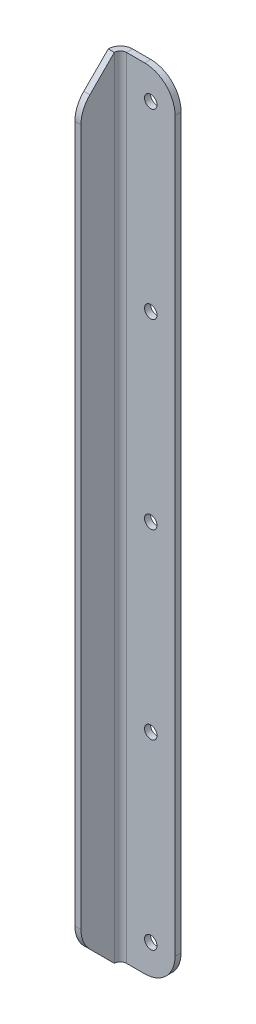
ISO-10303-21;
HEADER;
FILE_DESCRIPTION(('STEP AP214'),'2;1');
FILE_NAME('part.step','',(''),(''),'','','');
FILE_SCHEMA(('AUTOMOTIVE_DESIGN { 1 0 10303 214 1 1 1 1 }'));
ENDSEC;
DATA;
#1=APPLICATION_CONTEXT('core data for automotive mechanical design processes');
#2=APPLICATION_PROTOCOL_DEFINITION('international standard','automotive_design',2000,#1);
#3=PRODUCT_CONTEXT('',#1,'mechanical');
#4=PRODUCT('Part','Part','',(#3));
#5=PRODUCT_RELATED_PRODUCT_CATEGORY('part','',(#4));
#6=PRODUCT_DEFINITION_FORMATION('','',#4);
#7=PRODUCT_DEFINITION_CONTEXT('part definition',#1,'design');
#8=PRODUCT_DEFINITION('design','',#6,#7);
#9=PRODUCT_DEFINITION_SHAPE('','',#8);
#10=(LENGTH_UNIT() NAMED_UNIT(*) SI_UNIT(.MILLI.,.METRE.));
#11=(NAMED_UNIT(*) PLANE_ANGLE_UNIT() SI_UNIT($,.RADIAN.));
#12=(NAMED_UNIT(*) SI_UNIT($,.STERADIAN.) SOLID_ANGLE_UNIT());
#13=UNCERTAINTY_MEASURE_WITH_UNIT(LENGTH_MEASURE(1.E-05),#10,'distance_accuracy_value','');
#14=(GEOMETRIC_REPRESENTATION_CONTEXT(3) GLOBAL_UNCERTAINTY_ASSIGNED_CONTEXT((#13)) GLOBAL_UNIT_ASSIGNED_CONTEXT((#10,
#11,#12)) REPRESENTATION_CONTEXT('',''));
#15=CARTESIAN_POINT('',(0.,0.,0.));
#16=DIRECTION('',(0.,0.,1.));
#17=DIRECTION('',(1.,0.,0.));
#18=AXIS2_PLACEMENT_3D('',#15,#16,#17);
#19=CARTESIAN_POINT('',(8.,-130.,-2.));
#20=DIRECTION('',(1.,0.,0.));
#21=DIRECTION('',(0.,0.,-1.));
#22=AXIS2_PLACEMENT_3D('',#19,#20,#21);
#23=PLANE('',#22);
#24=DIRECTION('',(0.,1.,0.));
#25=VECTOR('',#24,1.);
#26=CARTESIAN_POINT('',(8.,-130.,0.));
#27=LINE('',#26,#25);
#28=CARTESIAN_POINT('',(8.,-120.,0.));
#29=VERTEX_POINT('',#28);
#30=CARTESIAN_POINT('',(8.,120.,0.));
#31=VERTEX_POINT('',#30);
#32=EDGE_CURVE('E247',#29,#31,#27,.T.);
#33=ORIENTED_EDGE('',*,*,#32,.F.);
#34=DIRECTION('',(0.,0.,1.));
#35=VECTOR('',#34,1.);
#36=CARTESIAN_POINT('',(8.,-120.,-2.));
#37=LINE('',#36,#35);
#38=CARTESIAN_POINT('',(8.,-120.,-2.));
#39=VERTEX_POINT('',#38);
#40=EDGE_CURVE('E219',#29,#39,#37,.F.);
#41=ORIENTED_EDGE('',*,*,#40,.T.);
#42=DIRECTION('',(0.,1.,0.));
#43=VECTOR('',#42,1.);
#44=CARTESIAN_POINT('',(8.,-130.,-2.));
#45=LINE('',#44,#43);
#46=CARTESIAN_POINT('',(8.,120.,-2.));
#47=VERTEX_POINT('',#46);
#48=EDGE_CURVE('E253',#39,#47,#45,.T.);
#49=ORIENTED_EDGE('',*,*,#48,.T.);
#50=DIRECTION('',(0.,0.,1.));
#51=VECTOR('',#50,1.);
#52=CARTESIAN_POINT('',(8.,120.,-2.));
#53=LINE('',#52,#51);
#54=EDGE_CURVE('E216',#47,#31,#53,.T.);
#55=ORIENTED_EDGE('',*,*,#54,.T.);
#56=EDGE_LOOP('',(#33,#41,#49,#55));
#57=FACE_BOUND('',#56,.T.);
#58=ADVANCED_FACE('F57',(#57),#23,.T.);
#59=CARTESIAN_POINT('',(-8.,-130.,-2.));
#60=DIRECTION('',(0.,-1.,0.));
#61=DIRECTION('',(0.,0.,-1.));
#62=AXIS2_PLACEMENT_3D('',#59,#60,#61);
#63=PLANE('',#62);
#64=DIRECTION('',(1.,0.,0.));
#65=VECTOR('',#64,1.);
#66=CARTESIAN_POINT('',(-8.,-130.,-2.));
#67=LINE('',#66,#65);
#68=CARTESIAN_POINT('',(-8.,-130.,-2.));
#69=VERTEX_POINT('',#68);
#70=CARTESIAN_POINT('',(-2.,-130.,-2.));
#71=VERTEX_POINT('',#70);
#72=EDGE_CURVE('E259',#69,#71,#67,.T.);
#73=ORIENTED_EDGE('',*,*,#72,.T.);
#74=DIRECTION('',(0.,0.,1.));
#75=VECTOR('',#74,1.);
#76=CARTESIAN_POINT('',(-2.,-130.,-2.));
#77=LINE('',#76,#75);
#78=CARTESIAN_POINT('',(-2.,-130.,0.));
#79=VERTEX_POINT('',#78);
#80=EDGE_CURVE('E209',#71,#79,#77,.T.);
#81=ORIENTED_EDGE('',*,*,#80,.T.);
#82=DIRECTION('',(1.,0.,0.));
#83=VECTOR('',#82,1.);
#84=CARTESIAN_POINT('',(-8.,-130.,0.));
#85=LINE('',#84,#83);
#86=CARTESIAN_POINT('',(-8.,-130.,0.));
#87=VERTEX_POINT('',#86);
#88=EDGE_CURVE('E256',#87,#79,#85,.T.);
#89=ORIENTED_EDGE('',*,*,#88,.F.);
#90=DIRECTION('',(0.,0.,1.));
#91=VECTOR('',#90,1.);
#92=CARTESIAN_POINT('',(-8.,-130.,-2.));
#93=LINE('',#92,#91);
#94=EDGE_CURVE('E271',#69,#87,#93,.T.);
#95=ORIENTED_EDGE('',*,*,#94,.F.);
#96=EDGE_LOOP('',(#73,#81,#89,#95));
#97=FACE_BOUND('',#96,.T.);
#98=ADVANCED_FACE('F295',(#97),#63,.T.);
#99=CARTESIAN_POINT('',(-8.,130.,-2.));
#100=DIRECTION('',(0.,1.,0.));
#101=DIRECTION('',(0.,0.,1.));
#102=AXIS2_PLACEMENT_3D('',#99,#100,#101);
#103=PLANE('',#102);
#104=DIRECTION('',(-1.,0.,0.));
#105=VECTOR('',#104,1.);
#106=CARTESIAN_POINT('',(-8.,130.,0.));
#107=LINE('',#106,#105);
#108=CARTESIAN_POINT('',(-2.,130.,0.));
#109=VERTEX_POINT('',#108);
#110=CARTESIAN_POINT('',(-8.,130.,0.));
#111=VERTEX_POINT('',#110);
#112=EDGE_CURVE('E265',#109,#111,#107,.T.);
#113=ORIENTED_EDGE('',*,*,#112,.F.);
#114=DIRECTION('',(0.,0.,1.));
#115=VECTOR('',#114,1.);
#116=CARTESIAN_POINT('',(-2.,130.,-2.));
#117=LINE('',#116,#115);
#118=CARTESIAN_POINT('',(-2.,130.,-2.));
#119=VERTEX_POINT('',#118);
#120=EDGE_CURVE('E13',#109,#119,#117,.F.);
#121=ORIENTED_EDGE('',*,*,#120,.T.);
#122=DIRECTION('',(-1.,0.,0.));
#123=VECTOR('',#122,1.);
#124=CARTESIAN_POINT('',(-8.,130.,-2.));
#125=LINE('',#124,#123);
#126=CARTESIAN_POINT('',(-8.,130.,-2.));
#127=VERTEX_POINT('',#126);
#128=EDGE_CURVE('E255',#119,#127,#125,.T.);
#129=ORIENTED_EDGE('',*,*,#128,.T.);
#130=DIRECTION('',(0.,0.,1.));
#131=VECTOR('',#130,1.);
#132=CARTESIAN_POINT('',(-8.,130.,-2.));
#133=LINE('',#132,#131);
#134=EDGE_CURVE('E262',#127,#111,#133,.T.);
#135=ORIENTED_EDGE('',*,*,#134,.T.);
#136=EDGE_LOOP('',(#113,#121,#129,#135));
#137=FACE_BOUND('',#136,.T.);
#138=ADVANCED_FACE('F288',(#137),#103,.T.);
#139=CARTESIAN_POINT('',(0.,0.,-2.));
#140=DIRECTION('',(0.,0.,-1.));
#141=DIRECTION('',(-1.,0.,0.));
#142=AXIS2_PLACEMENT_3D('',#139,#140,#141);
#143=PLANE('',#142);
#144=CARTESIAN_POINT('',(1.25693328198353E-12,120.,-2.));
#145=DIRECTION('',(0.,0.,-1.));
#146=DIRECTION('',(-1.,0.,0.));
#147=AXIS2_PLACEMENT_3D('',#144,#145,#146);
#148=CIRCLE('',#147,2.05);
#149=CARTESIAN_POINT('',(-2.04999999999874,120.,-2.));
#150=VERTEX_POINT('',#149);
#151=EDGE_CURVE('E227',#150,#150,#148,.T.);
#152=ORIENTED_EDGE('',*,*,#151,.F.);
#153=EDGE_LOOP('',(#152));
#154=FACE_BOUND('',#153,.T.);
#155=CARTESIAN_POINT('',(6.28466640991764E-13,60.,-2.));
#156=DIRECTION('',(0.,0.,-1.));
#157=DIRECTION('',(-1.,0.,0.));
#158=AXIS2_PLACEMENT_3D('',#155,#156,#157);
#159=CIRCLE('',#158,2.05);
#160=CARTESIAN_POINT('',(-2.04999999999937,60.,-2.));
#161=VERTEX_POINT('',#160);
#162=EDGE_CURVE('E352',#161,#161,#159,.T.);
#163=ORIENTED_EDGE('',*,*,#162,.F.);
#164=EDGE_LOOP('',(#163));
#165=FACE_BOUND('',#164,.T.);
#166=CARTESIAN_POINT('',(0.,0.,-2.));
#167=DIRECTION('',(0.,0.,-1.));
#168=DIRECTION('',(-1.,0.,0.));
#169=AXIS2_PLACEMENT_3D('',#166,#167,#168);
#170=CIRCLE('',#169,2.05);
#171=CARTESIAN_POINT('',(-2.05,0.,-2.));
#172=VERTEX_POINT('',#171);
#173=EDGE_CURVE('E349',#172,#172,#170,.T.);
#174=ORIENTED_EDGE('',*,*,#173,.F.);
#175=EDGE_LOOP('',(#174));
#176=FACE_BOUND('',#175,.T.);
#177=CARTESIAN_POINT('',(-6.28466640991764E-13,-60.,-2.));
#178=DIRECTION('',(0.,0.,-1.));
#179=DIRECTION('',(-1.,0.,0.));
#180=AXIS2_PLACEMENT_3D('',#177,#178,#179);
#181=CIRCLE('',#180,2.05);
#182=CARTESIAN_POINT('',(-2.05000000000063,-60.,-2.));
#183=VERTEX_POINT('',#182);
#184=EDGE_CURVE('E346',#183,#183,#181,.T.);
#185=ORIENTED_EDGE('',*,*,#184,.F.);
#186=EDGE_LOOP('',(#185));
#187=FACE_BOUND('',#186,.T.);
#188=CARTESIAN_POINT('',(-1.25693328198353E-12,-120.,-2.));
#189=DIRECTION('',(0.,0.,-1.));
#190=DIRECTION('',(-1.,0.,0.));
#191=AXIS2_PLACEMENT_3D('',#188,#189,#190);
#192=CIRCLE('',#191,2.05);
#193=CARTESIAN_POINT('',(-2.05000000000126,-120.,-2.));
#194=VERTEX_POINT('',#193);
#195=EDGE_CURVE('E343',#194,#194,#192,.T.);
#196=ORIENTED_EDGE('',*,*,#195,.F.);
#197=EDGE_LOOP('',(#196));
#198=FACE_BOUND('',#197,.T.);
#199=ORIENTED_EDGE('',*,*,#48,.F.);
#200=CARTESIAN_POINT('',(-2.,-120.,-2.));
#201=DIRECTION('',(0.,0.,-1.));
#202=DIRECTION('',(-1.,0.,0.));
#203=AXIS2_PLACEMENT_3D('',#200,#201,#202);
#204=CIRCLE('',#203,10.);
#205=EDGE_CURVE('E66',#39,#71,#204,.T.);
#206=ORIENTED_EDGE('',*,*,#205,.T.);
#207=ORIENTED_EDGE('',*,*,#72,.F.);
#208=DIRECTION('',(0.,-1.,0.));
#209=VECTOR('',#208,1.);
#210=CARTESIAN_POINT('',(-8.,-130.,-2.));
#211=LINE('',#210,#209);
#212=EDGE_CURVE('E157',#127,#69,#211,.T.);
#213=ORIENTED_EDGE('',*,*,#212,.F.);
#214=ORIENTED_EDGE('',*,*,#128,.F.);
#215=CARTESIAN_POINT('',(-2.,120.,-2.));
#216=DIRECTION('',(0.,0.,-1.));
#217=DIRECTION('',(-1.,0.,0.));
#218=AXIS2_PLACEMENT_3D('',#215,#216,#217);
#219=CIRCLE('',#218,10.);
#220=EDGE_CURVE('E79',#119,#47,#219,.T.);
#221=ORIENTED_EDGE('',*,*,#220,.T.);
#222=EDGE_LOOP('',(#199,#206,#207,#213,#214,#221));
#223=FACE_BOUND('',#222,.T.);
#224=ADVANCED_FACE('F289',(#154,#165,#176,#187,#198,#223),#143,.T.);
#225=CARTESIAN_POINT('',(0.,0.,0.));
#226=DIRECTION('',(0.,0.,-1.));
#227=DIRECTION('',(-1.,0.,0.));
#228=AXIS2_PLACEMENT_3D('',#225,#226,#227);
#229=PLANE('',#228);
#230=CARTESIAN_POINT('',(1.25693328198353E-12,120.,0.));
#231=DIRECTION('',(0.,0.,-1.));
#232=DIRECTION('',(-1.,0.,0.));
#233=AXIS2_PLACEMENT_3D('',#230,#231,#232);
#234=CIRCLE('',#233,2.05);
#235=CARTESIAN_POINT('',(-2.04999999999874,120.,0.));
#236=VERTEX_POINT('',#235);
#237=EDGE_CURVE('E61',#236,#236,#234,.T.);
#238=ORIENTED_EDGE('',*,*,#237,.T.);
#239=EDGE_LOOP('',(#238));
#240=FACE_BOUND('',#239,.T.);
#241=CARTESIAN_POINT('',(6.28466640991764E-13,60.,0.));
#242=DIRECTION('',(0.,0.,-1.));
#243=DIRECTION('',(-1.,0.,0.));
#244=AXIS2_PLACEMENT_3D('',#241,#242,#243);
#245=CIRCLE('',#244,2.05);
#246=CARTESIAN_POINT('',(-2.04999999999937,60.,0.));
#247=VERTEX_POINT('',#246);
#248=EDGE_CURVE('E232',#247,#247,#245,.T.);
#249=ORIENTED_EDGE('',*,*,#248,.T.);
#250=EDGE_LOOP('',(#249));
#251=FACE_BOUND('',#250,.T.);
#252=CARTESIAN_POINT('',(0.,0.,0.));
#253=DIRECTION('',(0.,0.,-1.));
#254=DIRECTION('',(-1.,0.,0.));
#255=AXIS2_PLACEMENT_3D('',#252,#253,#254);
#256=CIRCLE('',#255,2.05);
#257=CARTESIAN_POINT('',(-2.05,0.,0.));
#258=VERTEX_POINT('',#257);
#259=EDGE_CURVE('E230',#258,#258,#256,.T.);
#260=ORIENTED_EDGE('',*,*,#259,.T.);
#261=EDGE_LOOP('',(#260));
#262=FACE_BOUND('',#261,.T.);
#263=CARTESIAN_POINT('',(-6.28466640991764E-13,-60.,0.));
#264=DIRECTION('',(0.,0.,-1.));
#265=DIRECTION('',(-1.,0.,0.));
#266=AXIS2_PLACEMENT_3D('',#263,#264,#265);
#267=CIRCLE('',#266,2.05);
#268=CARTESIAN_POINT('',(-2.05000000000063,-60.,0.));
#269=VERTEX_POINT('',#268);
#270=EDGE_CURVE('E226',#269,#269,#267,.T.);
#271=ORIENTED_EDGE('',*,*,#270,.T.);
#272=EDGE_LOOP('',(#271));
#273=FACE_BOUND('',#272,.T.);
#274=CARTESIAN_POINT('',(-1.25693328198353E-12,-120.,0.));
#275=DIRECTION('',(0.,0.,-1.));
#276=DIRECTION('',(-1.,0.,0.));
#277=AXIS2_PLACEMENT_3D('',#274,#275,#276);
#278=CIRCLE('',#277,2.05);
#279=CARTESIAN_POINT('',(-2.05000000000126,-120.,0.));
#280=VERTEX_POINT('',#279);
#281=EDGE_CURVE('E223',#280,#280,#278,.T.);
#282=ORIENTED_EDGE('',*,*,#281,.T.);
#283=EDGE_LOOP('',(#282));
#284=FACE_BOUND('',#283,.T.);
#285=ORIENTED_EDGE('',*,*,#88,.T.);
#286=CARTESIAN_POINT('',(-2.,-120.,0.));
#287=DIRECTION('',(0.,0.,-1.));
#288=DIRECTION('',(-1.,0.,0.));
#289=AXIS2_PLACEMENT_3D('',#286,#287,#288);
#290=CIRCLE('',#289,10.);
#291=EDGE_CURVE('E214',#79,#29,#290,.F.);
#292=ORIENTED_EDGE('',*,*,#291,.T.);
#293=ORIENTED_EDGE('',*,*,#32,.T.);
#294=CARTESIAN_POINT('',(-2.,120.,0.));
#295=DIRECTION('',(0.,0.,-1.));
#296=DIRECTION('',(-1.,0.,0.));
#297=AXIS2_PLACEMENT_3D('',#294,#295,#296);
#298=CIRCLE('',#297,10.);
#299=EDGE_CURVE('E212',#31,#109,#298,.F.);
#300=ORIENTED_EDGE('',*,*,#299,.T.);
#301=ORIENTED_EDGE('',*,*,#112,.T.);
#302=DIRECTION('',(0.,-1.,0.));
#303=VECTOR('',#302,1.);
#304=CARTESIAN_POINT('',(-8.,-130.,0.));
#305=LINE('',#304,#303);
#306=EDGE_CURVE('E267',#111,#87,#305,.T.);
#307=ORIENTED_EDGE('',*,*,#306,.T.);
#308=EDGE_LOOP('',(#285,#292,#293,#300,#301,#307));
#309=FACE_BOUND('',#308,.T.);
#310=ADVANCED_FACE('F297',(#240,#251,#262,#273,#284,#309),#229,.F.);
#311=CARTESIAN_POINT('',(-8.,130.,2.));
#312=DIRECTION('',(0.,1.,0.));
#313=DIRECTION('',(0.,0.,1.));
#314=AXIS2_PLACEMENT_3D('',#311,#312,#313);
#315=PLANE('',#314);
#316=DIRECTION('',(1.,0.,0.));
#317=VECTOR('',#316,1.);
#318=CARTESIAN_POINT('',(-12.,130.,1.99999999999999));
#319=LINE('',#318,#317);
#320=CARTESIAN_POINT('',(-10.,130.,1.99999999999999));
#321=VERTEX_POINT('',#320);
#322=CARTESIAN_POINT('',(-12.,130.,1.99999999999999));
#323=VERTEX_POINT('',#322);
#324=EDGE_CURVE('E237',#321,#323,#319,.F.);
#325=ORIENTED_EDGE('',*,*,#324,.F.);
#326=CARTESIAN_POINT('',(-8.,130.,2.));
#327=DIRECTION('',(0.,-1.,0.));
#328=DIRECTION('',(0.,0.,-1.));
#329=AXIS2_PLACEMENT_3D('',#326,#327,#328);
#330=CIRCLE('',#329,2.);
#331=EDGE_CURVE('E161',#111,#321,#330,.F.);
#332=ORIENTED_EDGE('',*,*,#331,.F.);
#333=ORIENTED_EDGE('',*,*,#134,.F.);
#334=CARTESIAN_POINT('',(-8.,130.,2.));
#335=DIRECTION('',(0.,-1.,0.));
#336=DIRECTION('',(0.,0.,-1.));
#337=AXIS2_PLACEMENT_3D('',#334,#335,#336);
#338=CIRCLE('',#337,4.);
#339=EDGE_CURVE('E160',#127,#323,#338,.F.);
#340=ORIENTED_EDGE('',*,*,#339,.T.);
#341=EDGE_LOOP('',(#325,#332,#333,#340));
#342=FACE_BOUND('',#341,.T.);
#343=ADVANCED_FACE('F287',(#342),#315,.T.);
#344=CARTESIAN_POINT('',(-8.,-130.,2.));
#345=DIRECTION('',(0.,1.,0.));
#346=DIRECTION('',(0.,0.,1.));
#347=AXIS2_PLACEMENT_3D('',#344,#345,#346);
#348=PLANE('',#347);
#349=CARTESIAN_POINT('',(-8.,-130.,2.));
#350=DIRECTION('',(0.,-1.,0.));
#351=DIRECTION('',(0.,0.,-1.));
#352=AXIS2_PLACEMENT_3D('',#349,#350,#351);
#353=CIRCLE('',#352,2.);
#354=CARTESIAN_POINT('',(-10.,-130.,1.99999999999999));
#355=VERTEX_POINT('',#354);
#356=EDGE_CURVE('E168',#355,#87,#353,.T.);
#357=ORIENTED_EDGE('',*,*,#356,.F.);
#358=DIRECTION('',(1.,0.,0.));
#359=VECTOR('',#358,1.);
#360=CARTESIAN_POINT('',(-10.,-130.,1.99999999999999));
#361=LINE('',#360,#359);
#362=CARTESIAN_POINT('',(-12.,-130.,1.99999999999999));
#363=VERTEX_POINT('',#362);
#364=EDGE_CURVE('E165',#355,#363,#361,.F.);
#365=ORIENTED_EDGE('',*,*,#364,.T.);
#366=CARTESIAN_POINT('',(-8.,-130.,2.));
#367=DIRECTION('',(0.,-1.,0.));
#368=DIRECTION('',(0.,0.,-1.));
#369=AXIS2_PLACEMENT_3D('',#366,#367,#368);
#370=CIRCLE('',#369,4.);
#371=EDGE_CURVE('E149',#363,#69,#370,.T.);
#372=ORIENTED_EDGE('',*,*,#371,.T.);
#373=ORIENTED_EDGE('',*,*,#94,.T.);
#374=EDGE_LOOP('',(#357,#365,#372,#373));
#375=FACE_BOUND('',#374,.T.);
#376=ADVANCED_FACE('F166',(#375),#348,.F.);
#377=CARTESIAN_POINT('',(-8.,-130.,2.));
#378=DIRECTION('',(0.,-1.,0.));
#379=DIRECTION('',(-1.,0.,0.));
#380=AXIS2_PLACEMENT_3D('',#377,#378,#379);
#381=CYLINDRICAL_SURFACE('',#380,4.);
#382=ORIENTED_EDGE('',*,*,#212,.T.);
#383=ORIENTED_EDGE('',*,*,#371,.F.);
#384=DIRECTION('',(0.,-1.,0.));
#385=VECTOR('',#384,1.);
#386=CARTESIAN_POINT('',(-12.,130.,1.99999999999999));
#387=LINE('',#386,#385);
#388=EDGE_CURVE('E154',#363,#323,#387,.F.);
#389=ORIENTED_EDGE('',*,*,#388,.T.);
#390=ORIENTED_EDGE('',*,*,#339,.F.);
#391=EDGE_LOOP('',(#382,#383,#389,#390));
#392=FACE_BOUND('',#391,.T.);
#393=ADVANCED_FACE('F151',(#392),#381,.T.);
#394=CARTESIAN_POINT('',(-8.,-130.,2.));
#395=DIRECTION('',(0.,-1.,0.));
#396=DIRECTION('',(-1.,0.,0.));
#397=AXIS2_PLACEMENT_3D('',#394,#395,#396);
#398=CYLINDRICAL_SURFACE('',#397,2.);
#399=ORIENTED_EDGE('',*,*,#306,.F.);
#400=ORIENTED_EDGE('',*,*,#331,.T.);
#401=DIRECTION('',(0.,-1.,0.));
#402=VECTOR('',#401,1.);
#403=CARTESIAN_POINT('',(-10.,130.,1.99999999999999));
#404=LINE('',#403,#402);
#405=EDGE_CURVE('E172',#321,#355,#404,.T.);
#406=ORIENTED_EDGE('',*,*,#405,.T.);
#407=ORIENTED_EDGE('',*,*,#356,.T.);
#408=EDGE_LOOP('',(#399,#400,#406,#407));
#409=FACE_BOUND('',#408,.T.);
#410=ADVANCED_FACE('F283',(#409),#398,.F.);
#411=CARTESIAN_POINT('',(-12.,0.,0.));
#412=DIRECTION('',(1.,0.,0.));
#413=DIRECTION('',(0.,0.,-1.));
#414=AXIS2_PLACEMENT_3D('',#411,#412,#413);
#415=PLANE('',#414);
#416=DIRECTION('',(0.,1.,0.));
#417=VECTOR('',#416,1.);
#418=CARTESIAN_POINT('',(-12.,0.,13.));
#419=LINE('',#418,#417);
#420=CARTESIAN_POINT('',(-12.,-114.857864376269,13.));
#421=VERTEX_POINT('',#420);
#422=CARTESIAN_POINT('',(-12.,114.857864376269,13.));
#423=VERTEX_POINT('',#422);
#424=EDGE_CURVE('E252',#421,#423,#419,.T.);
#425=ORIENTED_EDGE('',*,*,#424,.T.);
#426=CARTESIAN_POINT('',(-12.,114.857864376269,3.));
#427=DIRECTION('',(1.,0.,0.));
#428=DIRECTION('',(0.,0.,-1.));
#429=AXIS2_PLACEMENT_3D('',#426,#427,#428);
#430=CIRCLE('',#429,10.);
#431=CARTESIAN_POINT('',(-12.,121.928932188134,10.0710678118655));
#432=VERTEX_POINT('',#431);
#433=EDGE_CURVE('E200',#423,#432,#430,.F.);
#434=ORIENTED_EDGE('',*,*,#433,.T.);
#435=DIRECTION('',(0.,-0.707106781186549,0.707106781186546));
#436=VECTOR('',#435,1.);
#437=CARTESIAN_POINT('',(-12.,130.,2.00000000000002));
#438=LINE('',#437,#436);
#439=EDGE_CURVE('E181',#432,#323,#438,.F.);
#440=ORIENTED_EDGE('',*,*,#439,.T.);
#441=ORIENTED_EDGE('',*,*,#388,.F.);
#442=DIRECTION('',(0.,-0.707106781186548,-0.707106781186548));
#443=VECTOR('',#442,1.);
#444=CARTESIAN_POINT('',(-12.,-119.,13.));
#445=LINE('',#444,#443);
#446=CARTESIAN_POINT('',(-12.,-121.928932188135,10.0710678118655));
#447=VERTEX_POINT('',#446);
#448=EDGE_CURVE('E178',#363,#447,#445,.F.);
#449=ORIENTED_EDGE('',*,*,#448,.T.);
#450=CARTESIAN_POINT('',(-12.,-114.857864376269,3.));
#451=DIRECTION('',(1.,0.,0.));
#452=DIRECTION('',(0.,0.,-1.));
#453=AXIS2_PLACEMENT_3D('',#450,#451,#452);
#454=CIRCLE('',#453,10.);
#455=EDGE_CURVE('E198',#447,#421,#454,.F.);
#456=ORIENTED_EDGE('',*,*,#455,.T.);
#457=EDGE_LOOP('',(#425,#434,#440,#441,#449,#456));
#458=FACE_BOUND('',#457,.T.);
#459=ADVANCED_FACE('F177',(#458),#415,.F.);
#460=CARTESIAN_POINT('',(-9.99999999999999,0.,0.));
#461=DIRECTION('',(1.,0.,0.));
#462=DIRECTION('',(0.,0.,-1.));
#463=AXIS2_PLACEMENT_3D('',#460,#461,#462);
#464=PLANE('',#463);
#465=DIRECTION('',(0.,0.707106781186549,-0.707106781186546));
#466=VECTOR('',#465,1.);
#467=CARTESIAN_POINT('',(-10.0000000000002,65.9999999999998,66.));
#468=LINE('',#467,#466);
#469=CARTESIAN_POINT('',(-10.,121.928932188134,10.0710678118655));
#470=VERTEX_POINT('',#469);
#471=EDGE_CURVE('E273',#321,#470,#468,.F.);
#472=ORIENTED_EDGE('',*,*,#471,.T.);
#473=CARTESIAN_POINT('',(-10.,114.857864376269,3.00000000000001));
#474=DIRECTION('',(1.,0.,0.));
#475=DIRECTION('',(0.,0.,-1.));
#476=AXIS2_PLACEMENT_3D('',#473,#474,#475);
#477=CIRCLE('',#476,10.);
#478=CARTESIAN_POINT('',(-10.,114.857864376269,13.));
#479=VERTEX_POINT('',#478);
#480=EDGE_CURVE('E206',#470,#479,#477,.T.);
#481=ORIENTED_EDGE('',*,*,#480,.T.);
#482=DIRECTION('',(0.,-1.,0.));
#483=VECTOR('',#482,1.);
#484=CARTESIAN_POINT('',(-10.,130.,13.));
#485=LINE('',#484,#483);
#486=CARTESIAN_POINT('',(-10.,-114.857864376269,13.));
#487=VERTEX_POINT('',#486);
#488=EDGE_CURVE('E182',#487,#479,#485,.F.);
#489=ORIENTED_EDGE('',*,*,#488,.F.);
#490=CARTESIAN_POINT('',(-10.,-114.857864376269,3.00000000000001));
#491=DIRECTION('',(1.,0.,0.));
#492=DIRECTION('',(0.,0.,-1.));
#493=AXIS2_PLACEMENT_3D('',#490,#491,#492);
#494=CIRCLE('',#493,10.);
#495=CARTESIAN_POINT('',(-10.,-121.928932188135,10.0710678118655));
#496=VERTEX_POINT('',#495);
#497=EDGE_CURVE('E204',#487,#496,#494,.T.);
#498=ORIENTED_EDGE('',*,*,#497,.T.);
#499=DIRECTION('',(0.,0.707106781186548,0.707106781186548));
#500=VECTOR('',#499,1.);
#501=CARTESIAN_POINT('',(-10.0000000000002,-66.,66.));
#502=LINE('',#501,#500);
#503=EDGE_CURVE('E192',#496,#355,#502,.F.);
#504=ORIENTED_EDGE('',*,*,#503,.T.);
#505=ORIENTED_EDGE('',*,*,#405,.F.);
#506=EDGE_LOOP('',(#472,#481,#489,#498,#504,#505));
#507=FACE_BOUND('',#506,.T.);
#508=ADVANCED_FACE('F279',(#507),#464,.T.);
#509=CARTESIAN_POINT('',(-12.,130.,13.));
#510=DIRECTION('',(0.,0.,-1.));
#511=DIRECTION('',(-1.,0.,0.));
#512=AXIS2_PLACEMENT_3D('',#509,#510,#511);
#513=PLANE('',#512);
#514=ORIENTED_EDGE('',*,*,#488,.T.);
#515=DIRECTION('',(1.,0.,0.));
#516=VECTOR('',#515,1.);
#517=CARTESIAN_POINT('',(-12.,114.857864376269,13.));
#518=LINE('',#517,#516);
#519=EDGE_CURVE('E190',#479,#423,#518,.F.);
#520=ORIENTED_EDGE('',*,*,#519,.T.);
#521=ORIENTED_EDGE('',*,*,#424,.F.);
#522=DIRECTION('',(-1.,0.,0.));
#523=VECTOR('',#522,1.);
#524=CARTESIAN_POINT('',(-10.,-114.857864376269,13.));
#525=LINE('',#524,#523);
#526=EDGE_CURVE('E187',#421,#487,#525,.F.);
#527=ORIENTED_EDGE('',*,*,#526,.T.);
#528=EDGE_LOOP('',(#514,#520,#521,#527));
#529=FACE_BOUND('',#528,.T.);
#530=ADVANCED_FACE('F326',(#529),#513,.F.);
#531=CARTESIAN_POINT('',(-12.,-119.,13.));
#532=DIRECTION('',(0.,0.707106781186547,-0.707106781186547));
#533=DIRECTION('',(1.,0.,0.));
#534=AXIS2_PLACEMENT_3D('',#531,#532,#533);
#535=PLANE('',#534);
#536=ORIENTED_EDGE('',*,*,#503,.F.);
#537=DIRECTION('',(1.,0.,0.));
#538=VECTOR('',#537,1.);
#539=CARTESIAN_POINT('',(-12.,-121.928932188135,10.0710678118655));
#540=LINE('',#539,#538);
#541=EDGE_CURVE('E186',#496,#447,#540,.F.);
#542=ORIENTED_EDGE('',*,*,#541,.T.);
#543=ORIENTED_EDGE('',*,*,#448,.F.);
#544=ORIENTED_EDGE('',*,*,#364,.F.);
#545=EDGE_LOOP('',(#536,#542,#543,#544));
#546=FACE_BOUND('',#545,.T.);
#547=ADVANCED_FACE('F184',(#546),#535,.F.);
#548=CARTESIAN_POINT('',(-12.,130.,2.00000000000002));
#549=DIRECTION('',(0.,-0.707106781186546,-0.707106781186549));
#550=DIRECTION('',(1.,0.,0.));
#551=AXIS2_PLACEMENT_3D('',#548,#549,#550);
#552=PLANE('',#551);
#553=ORIENTED_EDGE('',*,*,#439,.F.);
#554=DIRECTION('',(-1.,0.,0.));
#555=VECTOR('',#554,1.);
#556=CARTESIAN_POINT('',(-10.,121.928932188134,10.0710678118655));
#557=LINE('',#556,#555);
#558=EDGE_CURVE('E202',#432,#470,#557,.F.);
#559=ORIENTED_EDGE('',*,*,#558,.T.);
#560=ORIENTED_EDGE('',*,*,#471,.F.);
#561=ORIENTED_EDGE('',*,*,#324,.T.);
#562=EDGE_LOOP('',(#553,#559,#560,#561));
#563=FACE_BOUND('',#562,.T.);
#564=ADVANCED_FACE('F325',(#563),#552,.F.);
#565=CARTESIAN_POINT('',(-12.,114.857864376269,3.));
#566=DIRECTION('',(-1.,0.,0.));
#567=DIRECTION('',(0.,0.,1.));
#568=AXIS2_PLACEMENT_3D('',#565,#566,#567);
#569=CYLINDRICAL_SURFACE('',#568,10.);
#570=ORIENTED_EDGE('',*,*,#480,.F.);
#571=ORIENTED_EDGE('',*,*,#558,.F.);
#572=ORIENTED_EDGE('',*,*,#433,.F.);
#573=ORIENTED_EDGE('',*,*,#519,.F.);
#574=EDGE_LOOP('',(#570,#571,#572,#573));
#575=FACE_BOUND('',#574,.T.);
#576=ADVANCED_FACE('F312',(#575),#569,.T.);
#577=CARTESIAN_POINT('',(-12.,-114.857864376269,3.));
#578=DIRECTION('',(1.,0.,0.));
#579=DIRECTION('',(0.,0.,-1.));
#580=AXIS2_PLACEMENT_3D('',#577,#578,#579);
#581=CYLINDRICAL_SURFACE('',#580,10.);
#582=ORIENTED_EDGE('',*,*,#455,.F.);
#583=ORIENTED_EDGE('',*,*,#541,.F.);
#584=ORIENTED_EDGE('',*,*,#497,.F.);
#585=ORIENTED_EDGE('',*,*,#526,.F.);
#586=EDGE_LOOP('',(#582,#583,#584,#585));
#587=FACE_BOUND('',#586,.T.);
#588=ADVANCED_FACE('F306',(#587),#581,.T.);
#589=CARTESIAN_POINT('',(-2.,-120.,-2.));
#590=DIRECTION('',(0.,0.,1.));
#591=DIRECTION('',(1.,0.,0.));
#592=AXIS2_PLACEMENT_3D('',#589,#590,#591);
#593=CYLINDRICAL_SURFACE('',#592,10.);
#594=ORIENTED_EDGE('',*,*,#205,.F.);
#595=ORIENTED_EDGE('',*,*,#40,.F.);
#596=ORIENTED_EDGE('',*,*,#291,.F.);
#597=ORIENTED_EDGE('',*,*,#80,.F.);
#598=EDGE_LOOP('',(#594,#595,#596,#597));
#599=FACE_BOUND('',#598,.T.);
#600=ADVANCED_FACE('F304',(#599),#593,.T.);
#601=CARTESIAN_POINT('',(-2.,120.,-2.));
#602=DIRECTION('',(0.,0.,1.));
#603=DIRECTION('',(1.,0.,0.));
#604=AXIS2_PLACEMENT_3D('',#601,#602,#603);
#605=CYLINDRICAL_SURFACE('',#604,10.);
#606=ORIENTED_EDGE('',*,*,#220,.F.);
#607=ORIENTED_EDGE('',*,*,#120,.F.);
#608=ORIENTED_EDGE('',*,*,#299,.F.);
#609=ORIENTED_EDGE('',*,*,#54,.F.);
#610=EDGE_LOOP('',(#606,#607,#608,#609));
#611=FACE_BOUND('',#610,.T.);
#612=ADVANCED_FACE('F59',(#611),#605,.T.);
#613=CARTESIAN_POINT('',(-1.25693328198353E-12,-120.,13.));
#614=DIRECTION('',(0.,0.,-1.));
#615=DIRECTION('',(-1.,0.,0.));
#616=AXIS2_PLACEMENT_3D('',#613,#614,#615);
#617=CYLINDRICAL_SURFACE('',#616,2.05);
#618=ORIENTED_EDGE('',*,*,#195,.T.);
#619=EDGE_LOOP('',(#618));
#620=FACE_BOUND('',#619,.T.);
#621=ORIENTED_EDGE('',*,*,#281,.F.);
#622=EDGE_LOOP('',(#621));
#623=FACE_BOUND('',#622,.T.);
#624=ADVANCED_FACE('F311',(#620,#623),#617,.F.);
#625=CARTESIAN_POINT('',(-6.28466640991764E-13,-60.,13.));
#626=DIRECTION('',(0.,0.,-1.));
#627=DIRECTION('',(-1.,0.,0.));
#628=AXIS2_PLACEMENT_3D('',#625,#626,#627);
#629=CYLINDRICAL_SURFACE('',#628,2.05);
#630=ORIENTED_EDGE('',*,*,#184,.T.);
#631=EDGE_LOOP('',(#630));
#632=FACE_BOUND('',#631,.T.);
#633=ORIENTED_EDGE('',*,*,#270,.F.);
#634=EDGE_LOOP('',(#633));
#635=FACE_BOUND('',#634,.T.);
#636=ADVANCED_FACE('F374',(#632,#635),#629,.F.);
#637=CARTESIAN_POINT('',(0.,0.,13.));
#638=DIRECTION('',(0.,0.,-1.));
#639=DIRECTION('',(-1.,0.,0.));
#640=AXIS2_PLACEMENT_3D('',#637,#638,#639);
#641=CYLINDRICAL_SURFACE('',#640,2.05);
#642=ORIENTED_EDGE('',*,*,#173,.T.);
#643=EDGE_LOOP('',(#642));
#644=FACE_BOUND('',#643,.T.);
#645=ORIENTED_EDGE('',*,*,#259,.F.);
#646=EDGE_LOOP('',(#645));
#647=FACE_BOUND('',#646,.T.);
#648=ADVANCED_FACE('F399',(#644,#647),#641,.F.);
#649=CARTESIAN_POINT('',(6.28466640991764E-13,60.,13.));
#650=DIRECTION('',(0.,0.,-1.));
#651=DIRECTION('',(-1.,0.,0.));
#652=AXIS2_PLACEMENT_3D('',#649,#650,#651);
#653=CYLINDRICAL_SURFACE('',#652,2.05);
#654=ORIENTED_EDGE('',*,*,#162,.T.);
#655=EDGE_LOOP('',(#654));
#656=FACE_BOUND('',#655,.T.);
#657=ORIENTED_EDGE('',*,*,#248,.F.);
#658=EDGE_LOOP('',(#657));
#659=FACE_BOUND('',#658,.T.);
#660=ADVANCED_FACE('F403',(#656,#659),#653,.F.);
#661=CARTESIAN_POINT('',(1.25693328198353E-12,120.,13.));
#662=DIRECTION('',(0.,0.,-1.));
#663=DIRECTION('',(-1.,0.,0.));
#664=AXIS2_PLACEMENT_3D('',#661,#662,#663);
#665=CYLINDRICAL_SURFACE('',#664,2.05);
#666=ORIENTED_EDGE('',*,*,#151,.T.);
#667=EDGE_LOOP('',(#666));
#668=FACE_BOUND('',#667,.T.);
#669=ORIENTED_EDGE('',*,*,#237,.F.);
#670=EDGE_LOOP('',(#669));
#671=FACE_BOUND('',#670,.T.);
#672=ADVANCED_FACE('F358',(#668,#671),#665,.F.);
#673=CLOSED_SHELL('',(#58,#98,#138,#224,#310,#343,#376,#393,#410,#459,#508,#530,#547,#564,#576,
#588,#600,#612,#624,#636,#648,#660,#672));
#674=MANIFOLD_SOLID_BREP('B2',#673);
#675=ADVANCED_BREP_SHAPE_REPRESENTATION('',(#18,#674),#14);
#676=SHAPE_DEFINITION_REPRESENTATION(#9,#675);
ENDSEC;
END-ISO-10303-21;
